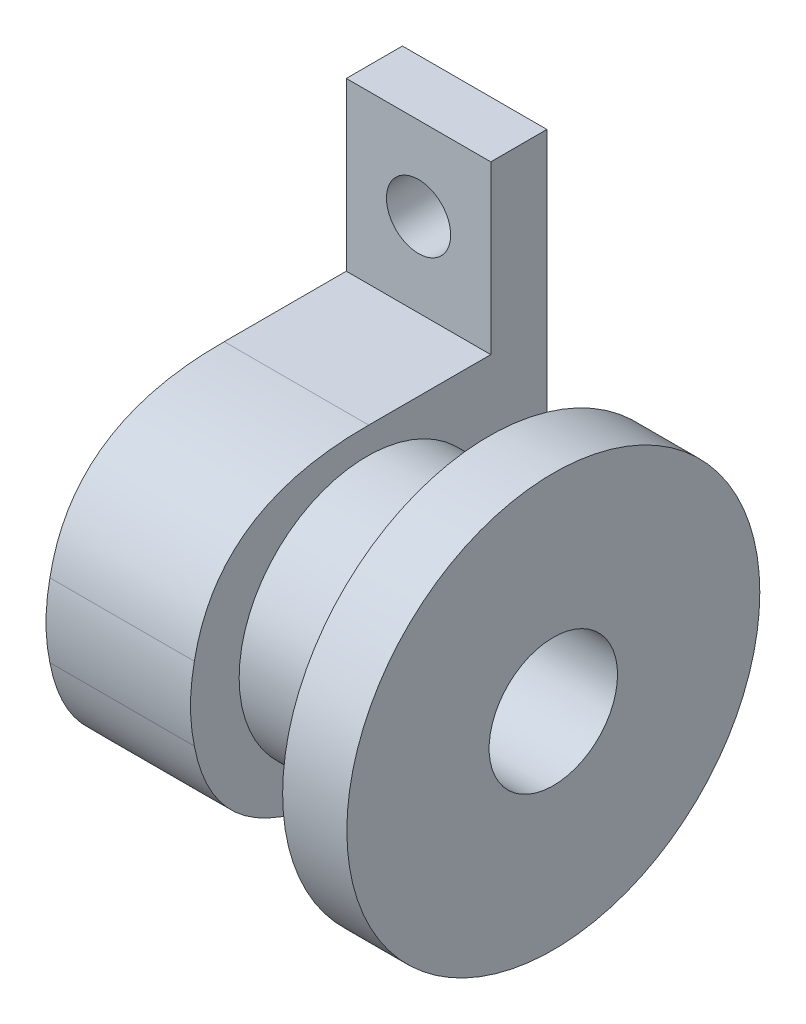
ISO-10303-21;
HEADER;
FILE_DESCRIPTION(('STEP AP214'),'2;1');
FILE_NAME('part.step','',(''),(''),'','','');
FILE_SCHEMA(('AUTOMOTIVE_DESIGN { 1 0 10303 214 1 1 1 1 }'));
ENDSEC;
DATA;
#1=APPLICATION_CONTEXT('core data for automotive mechanical design processes');
#2=APPLICATION_PROTOCOL_DEFINITION('international standard','automotive_design',2000,#1);
#3=PRODUCT_CONTEXT('',#1,'mechanical');
#4=PRODUCT('Part','Part','',(#3));
#5=PRODUCT_RELATED_PRODUCT_CATEGORY('part','',(#4));
#6=PRODUCT_DEFINITION_FORMATION('','',#4);
#7=PRODUCT_DEFINITION_CONTEXT('part definition',#1,'design');
#8=PRODUCT_DEFINITION('design','',#6,#7);
#9=PRODUCT_DEFINITION_SHAPE('','',#8);
#10=(LENGTH_UNIT() NAMED_UNIT(*) SI_UNIT(.MILLI.,.METRE.));
#11=(NAMED_UNIT(*) PLANE_ANGLE_UNIT() SI_UNIT($,.RADIAN.));
#12=(NAMED_UNIT(*) SI_UNIT($,.STERADIAN.) SOLID_ANGLE_UNIT());
#13=UNCERTAINTY_MEASURE_WITH_UNIT(LENGTH_MEASURE(1.E-05),#10,'distance_accuracy_value','');
#14=(GEOMETRIC_REPRESENTATION_CONTEXT(3) GLOBAL_UNCERTAINTY_ASSIGNED_CONTEXT((#13)) GLOBAL_UNIT_ASSIGNED_CONTEXT((#10,
#11,#12)) REPRESENTATION_CONTEXT('',''));
#15=CARTESIAN_POINT('',(0.,0.,0.));
#16=DIRECTION('',(0.,0.,1.));
#17=DIRECTION('',(1.,0.,0.));
#18=AXIS2_PLACEMENT_3D('',#15,#16,#17);
#19=CARTESIAN_POINT('',(22.5,-50.,8.7420219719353));
#20=DIRECTION('',(1.,0.,0.));
#21=DIRECTION('',(0.,0.,-1.));
#22=AXIS2_PLACEMENT_3D('',#19,#20,#21);
#23=PLANE('',#22);
#24=CARTESIAN_POINT('',(22.5,0.,28.));
#25=DIRECTION('',(1.,0.,0.));
#26=DIRECTION('',(0.,0.,-1.));
#27=AXIS2_PLACEMENT_3D('',#24,#25,#26);
#28=CIRCLE('',#27,10.);
#29=CARTESIAN_POINT('',(22.5,0.,18.));
#30=VERTEX_POINT('',#29);
#31=EDGE_CURVE('E157',#30,#30,#28,.F.);
#32=ORIENTED_EDGE('',*,*,#31,.T.);
#33=EDGE_LOOP('',(#32));
#34=FACE_BOUND('',#33,.T.);
#35=DIRECTION('',(0.,-1.,0.));
#36=VECTOR('',#35,1.);
#37=CARTESIAN_POINT('',(22.5,0.,8.7420219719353));
#38=LINE('',#37,#36);
#39=CARTESIAN_POINT('',(22.5,-24.,8.7420219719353));
#40=VERTEX_POINT('',#39);
#41=CARTESIAN_POINT('',(22.5,-50.,8.7420219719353));
#42=VERTEX_POINT('',#41);
#43=EDGE_CURVE('E329',#40,#42,#38,.T.);
#44=ORIENTED_EDGE('',*,*,#43,.T.);
#45=DIRECTION('',(0.,0.,-1.));
#46=VECTOR('',#45,1.);
#47=CARTESIAN_POINT('',(22.5,-50.,55.5));
#48=LINE('',#47,#46);
#49=CARTESIAN_POINT('',(22.5,-50.,0.));
#50=VERTEX_POINT('',#49);
#51=EDGE_CURVE('E252',#42,#50,#48,.T.);
#52=ORIENTED_EDGE('',*,*,#51,.T.);
#53=DIRECTION('',(0.,1.,0.));
#54=VECTOR('',#53,1.);
#55=CARTESIAN_POINT('',(22.5,-50.,0.));
#56=LINE('',#55,#54);
#57=CARTESIAN_POINT('',(22.5,50.,0.));
#58=VERTEX_POINT('',#57);
#59=EDGE_CURVE('E251',#50,#58,#56,.T.);
#60=ORIENTED_EDGE('',*,*,#59,.T.);
#61=DIRECTION('',(0.,0.,-1.));
#62=VECTOR('',#61,1.);
#63=CARTESIAN_POINT('',(22.5,50.,55.5));
#64=LINE('',#63,#62);
#65=CARTESIAN_POINT('',(22.5,50.,8.7420219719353));
#66=VERTEX_POINT('',#65);
#67=EDGE_CURVE('E241',#66,#58,#64,.T.);
#68=ORIENTED_EDGE('',*,*,#67,.F.);
#69=DIRECTION('',(0.,1.,0.));
#70=VECTOR('',#69,1.);
#71=CARTESIAN_POINT('',(22.5,0.,8.7420219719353));
#72=LINE('',#71,#70);
#73=CARTESIAN_POINT('',(22.5,24.,8.7420219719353));
#74=VERTEX_POINT('',#73);
#75=EDGE_CURVE('E280',#74,#66,#72,.T.);
#76=ORIENTED_EDGE('',*,*,#75,.F.);
#77=DIRECTION('',(0.,0.,1.));
#78=VECTOR('',#77,1.);
#79=CARTESIAN_POINT('',(22.5,24.,0.));
#80=LINE('',#79,#78);
#81=CARTESIAN_POINT('',(22.5,24.,27.75));
#82=VERTEX_POINT('',#81);
#83=EDGE_CURVE('E400',#74,#82,#80,.T.);
#84=ORIENTED_EDGE('',*,*,#83,.T.);
#85=CARTESIAN_POINT('',(22.5,0.,55.5));
#86=CARTESIAN_POINT('',(22.5,24.2004229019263,54.7772443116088));
#87=CARTESIAN_POINT('',(22.5,24.,27.75));
#88=B_SPLINE_CURVE_WITH_KNOTS('',2,(#85,#86,#87),.UNSPECIFIED.,.F.,.F.,(3,3),(0.,1.),.UNSPECIFIED.);
#89=CARTESIAN_POINT('',(22.5,5.71932993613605,54.8986851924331));
#90=VERTEX_POINT('',#89);
#91=EDGE_CURVE('E272',#90,#82,#88,.T.);
#92=ORIENTED_EDGE('',*,*,#91,.F.);
#93=CARTESIAN_POINT('',(22.5,0.,28.));
#94=DIRECTION('',(1.,0.,0.));
#95=DIRECTION('',(0.,0.,-1.));
#96=AXIS2_PLACEMENT_3D('',#93,#94,#95);
#97=CIRCLE('',#96,27.5);
#98=CARTESIAN_POINT('',(22.5,-5.7193299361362,54.898685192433));
#99=VERTEX_POINT('',#98);
#100=EDGE_CURVE('E268',#90,#99,#97,.T.);
#101=ORIENTED_EDGE('',*,*,#100,.T.);
#102=CARTESIAN_POINT('',(22.5,0.,55.5));
#103=CARTESIAN_POINT('',(22.5,-24.2004229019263,54.7772443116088));
#104=CARTESIAN_POINT('',(22.5,-24.,27.75));
#105=B_SPLINE_CURVE_WITH_KNOTS('',2,(#102,#103,#104),.UNSPECIFIED.,.F.,.F.,(3,3),(0.,1.),.UNSPECIFIED.);
#106=CARTESIAN_POINT('',(22.5,-24.,27.75));
#107=VERTEX_POINT('',#106);
#108=EDGE_CURVE('E427',#99,#107,#105,.T.);
#109=ORIENTED_EDGE('',*,*,#108,.T.);
#110=DIRECTION('',(0.,0.,1.));
#111=VECTOR('',#110,1.);
#112=CARTESIAN_POINT('',(22.5,-24.,0.));
#113=LINE('',#112,#111);
#114=EDGE_CURVE('E339',#40,#107,#113,.T.);
#115=ORIENTED_EDGE('',*,*,#114,.F.);
#116=EDGE_LOOP('',(#44,#52,#60,#68,#76,#84,#92,#101,#109,#115));
#117=FACE_BOUND('',#116,.T.);
#118=ADVANCED_FACE('F153',(#34,#117),#23,.T.);
#119=CARTESIAN_POINT('',(0.,0.,28.));
#120=DIRECTION('',(1.,0.,0.));
#121=DIRECTION('',(0.,0.,-1.));
#122=AXIS2_PLACEMENT_3D('',#119,#120,#121);
#123=CYLINDRICAL_SURFACE('',#122,10.);
#124=CARTESIAN_POINT('',(-5.,0.,28.));
#125=DIRECTION('',(-1.,0.,0.));
#126=DIRECTION('',(0.,0.,1.));
#127=AXIS2_PLACEMENT_3D('',#124,#125,#126);
#128=CIRCLE('',#127,10.);
#129=CARTESIAN_POINT('',(-5.,0.,18.));
#130=VERTEX_POINT('',#129);
#131=EDGE_CURVE('E13',#130,#130,#128,.F.);
#132=CARTESIAN_POINT('',(-5.,0.,18.));
#133=CARTESIAN_POINT('',(-4.71354166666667,0.,18.));
#134=CARTESIAN_POINT('',(-4.42708333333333,0.,18.));
#135=CARTESIAN_POINT('',(-3.85416666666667,0.,18.));
#136=CARTESIAN_POINT('',(-3.56770833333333,0.,18.));
#137=CARTESIAN_POINT('',(-2.99479166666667,0.,18.));
#138=CARTESIAN_POINT('',(-2.70833333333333,0.,18.));
#139=CARTESIAN_POINT('',(-2.13541666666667,0.,18.));
#140=CARTESIAN_POINT('',(-1.84895833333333,0.,18.));
#141=CARTESIAN_POINT('',(-1.27604166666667,0.,18.));
#142=CARTESIAN_POINT('',(-0.989583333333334,0.,18.));
#143=CARTESIAN_POINT('',(-0.416666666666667,0.,18.));
#144=CARTESIAN_POINT('',(-0.130208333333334,0.,18.));
#145=CARTESIAN_POINT('',(0.442708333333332,0.,18.));
#146=CARTESIAN_POINT('',(0.729166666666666,0.,18.));
#147=CARTESIAN_POINT('',(1.30208333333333,0.,18.));
#148=CARTESIAN_POINT('',(1.58854166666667,0.,18.));
#149=CARTESIAN_POINT('',(2.16145833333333,0.,18.));
#150=CARTESIAN_POINT('',(2.44791666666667,0.,18.));
#151=CARTESIAN_POINT('',(3.02083333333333,0.,18.));
#152=CARTESIAN_POINT('',(3.30729166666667,0.,18.));
#153=CARTESIAN_POINT('',(3.88020833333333,0.,18.));
#154=CARTESIAN_POINT('',(4.16666666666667,0.,18.));
#155=CARTESIAN_POINT('',(4.73958333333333,0.,18.));
#156=CARTESIAN_POINT('',(5.02604166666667,0.,18.));
#157=CARTESIAN_POINT('',(5.59895833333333,0.,18.));
#158=CARTESIAN_POINT('',(5.88541666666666,0.,18.));
#159=CARTESIAN_POINT('',(6.45833333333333,0.,18.));
#160=CARTESIAN_POINT('',(6.74479166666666,0.,18.));
#161=CARTESIAN_POINT('',(7.31770833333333,0.,18.));
#162=CARTESIAN_POINT('',(7.60416666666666,0.,18.));
#163=CARTESIAN_POINT('',(8.17708333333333,0.,18.));
#164=CARTESIAN_POINT('',(8.46354166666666,0.,18.));
#165=CARTESIAN_POINT('',(9.03645833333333,0.,18.));
#166=CARTESIAN_POINT('',(9.32291666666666,0.,18.));
#167=CARTESIAN_POINT('',(9.89583333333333,0.,18.));
#168=CARTESIAN_POINT('',(10.1822916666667,0.,18.));
#169=CARTESIAN_POINT('',(10.7552083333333,0.,18.));
#170=CARTESIAN_POINT('',(11.0416666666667,0.,18.));
#171=CARTESIAN_POINT('',(11.6145833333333,0.,18.));
#172=CARTESIAN_POINT('',(11.9010416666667,0.,18.));
#173=CARTESIAN_POINT('',(12.4739583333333,0.,18.));
#174=CARTESIAN_POINT('',(12.7604166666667,0.,18.));
#175=CARTESIAN_POINT('',(13.3333333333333,0.,18.));
#176=CARTESIAN_POINT('',(13.6197916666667,0.,18.));
#177=CARTESIAN_POINT('',(14.1927083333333,0.,18.));
#178=CARTESIAN_POINT('',(14.4791666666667,0.,18.));
#179=CARTESIAN_POINT('',(15.0520833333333,0.,18.));
#180=CARTESIAN_POINT('',(15.3385416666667,0.,18.));
#181=CARTESIAN_POINT('',(15.9114583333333,0.,18.));
#182=CARTESIAN_POINT('',(16.1979166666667,0.,18.));
#183=CARTESIAN_POINT('',(16.7708333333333,0.,18.));
#184=CARTESIAN_POINT('',(17.0572916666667,0.,18.));
#185=CARTESIAN_POINT('',(17.6302083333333,0.,18.));
#186=CARTESIAN_POINT('',(17.9166666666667,0.,18.));
#187=CARTESIAN_POINT('',(18.4895833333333,0.,18.));
#188=CARTESIAN_POINT('',(18.7760416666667,0.,18.));
#189=CARTESIAN_POINT('',(19.3489583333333,0.,18.));
#190=CARTESIAN_POINT('',(19.6354166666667,0.,18.));
#191=CARTESIAN_POINT('',(20.2083333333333,0.,18.));
#192=CARTESIAN_POINT('',(20.4947916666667,0.,18.));
#193=CARTESIAN_POINT('',(21.0677083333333,0.,18.));
#194=CARTESIAN_POINT('',(21.3541666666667,0.,18.));
#195=CARTESIAN_POINT('',(21.9270833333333,0.,18.));
#196=CARTESIAN_POINT('',(22.2135416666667,0.,18.));
#197=CARTESIAN_POINT('',(22.5,0.,18.));
#198=B_SPLINE_CURVE_WITH_KNOTS('',3,(#132,#133,#134,#135,#136,#137,#138,#139,#140,#141,#142,
#143,#144,#145,#146,#147,#148,#149,#150,#151,#152,#153,#154,#155,#156,#157,#158,#159,#160,#161,
#162,#163,#164,#165,#166,#167,#168,#169,#170,#171,#172,#173,#174,#175,#176,#177,#178,#179,#180,
#181,#182,#183,#184,#185,#186,#187,#188,#189,#190,#191,#192,#193,#194,#195,#196,#197),
.UNSPECIFIED.,.F.,.F.,(4,2,2,2,2,2,2,2,2,2,2,2,2,2,2,2,2,2,2,2,2,2,2,2,2,2,2,2,2,2,2,2,4),(0.,
0.859375,1.71875,2.578125,3.4375,4.296875,5.15625,6.015625,6.875,7.734375,8.59375,9.453125,
10.3125,11.171875,12.03125,12.890625,13.75,14.609375,15.46875,16.328125,17.1875,18.046875,
18.90625,19.765625,20.625,21.484375,22.34375,23.203125,24.0625,24.921875,25.78125,26.640625,
27.5),.UNSPECIFIED.);
#199=EDGE_CURVE('BSEAM155',#130,#30,#198,.T.);
#200=ORIENTED_EDGE('',*,*,#131,.F.);
#201=ORIENTED_EDGE('',*,*,#31,.F.);
#202=ORIENTED_EDGE('',*,*,#199,.T.);
#203=ORIENTED_EDGE('',*,*,#199,.F.);
#204=EDGE_LOOP('',(#200,#202,#201,#203));
#205=FACE_BOUND('',#204,.T.);
#206=ADVANCED_FACE('F155',(#205),#123,.F.);
#207=CARTESIAN_POINT('',(0.,-50.,55.5));
#208=DIRECTION('',(1.,0.,0.));
#209=DIRECTION('',(0.,0.,-1.));
#210=AXIS2_PLACEMENT_3D('',#207,#208,#209);
#211=PLANE('',#210);
#212=CARTESIAN_POINT('',(0.,0.,28.));
#213=DIRECTION('',(1.,0.,0.));
#214=DIRECTION('',(0.,0.,-1.));
#215=AXIS2_PLACEMENT_3D('',#212,#213,#214);
#216=CIRCLE('',#215,12.);
#217=CARTESIAN_POINT('',(0.,0.,16.));
#218=VERTEX_POINT('',#217);
#219=EDGE_CURVE('E360',#218,#218,#216,.F.);
#220=ORIENTED_EDGE('',*,*,#219,.F.);
#221=EDGE_LOOP('',(#220));
#222=FACE_BOUND('',#221,.T.);
#223=DIRECTION('',(0.,-1.,0.));
#224=VECTOR('',#223,1.);
#225=CARTESIAN_POINT('',(0.,0.,8.7420219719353));
#226=LINE('',#225,#224);
#227=CARTESIAN_POINT('',(0.,-24.,8.7420219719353));
#228=VERTEX_POINT('',#227);
#229=CARTESIAN_POINT('',(0.,-50.,8.7420219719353));
#230=VERTEX_POINT('',#229);
#231=EDGE_CURVE('E321',#228,#230,#226,.T.);
#232=ORIENTED_EDGE('',*,*,#231,.F.);
#233=DIRECTION('',(0.,0.,1.));
#234=VECTOR('',#233,1.);
#235=CARTESIAN_POINT('',(0.,-24.,0.));
#236=LINE('',#235,#234);
#237=CARTESIAN_POINT('',(0.,-24.,27.75));
#238=VERTEX_POINT('',#237);
#239=EDGE_CURVE('E320',#228,#238,#236,.T.);
#240=ORIENTED_EDGE('',*,*,#239,.T.);
#241=CARTESIAN_POINT('',(0.,0.,55.5));
#242=CARTESIAN_POINT('',(0.,-24.2004229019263,54.7772443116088));
#243=CARTESIAN_POINT('',(0.,-24.,27.75));
#244=B_SPLINE_CURVE_WITH_KNOTS('',2,(#241,#242,#243),.UNSPECIFIED.,.F.,.F.,(3,3),(0.,1.),.UNSPECIFIED.);
#245=CARTESIAN_POINT('',(0.,-5.7193299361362,54.898685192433));
#246=VERTEX_POINT('',#245);
#247=EDGE_CURVE('E195',#246,#238,#244,.T.);
#248=ORIENTED_EDGE('',*,*,#247,.F.);
#249=CARTESIAN_POINT('',(0.,0.,28.));
#250=DIRECTION('',(1.,0.,0.));
#251=DIRECTION('',(0.,0.,-1.));
#252=AXIS2_PLACEMENT_3D('',#249,#250,#251);
#253=CIRCLE('',#252,27.5);
#254=CARTESIAN_POINT('',(0.,5.71932993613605,54.8986851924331));
#255=VERTEX_POINT('',#254);
#256=EDGE_CURVE('E191',#255,#246,#253,.T.);
#257=ORIENTED_EDGE('',*,*,#256,.F.);
#258=CARTESIAN_POINT('',(0.,0.,55.5));
#259=CARTESIAN_POINT('',(0.,24.2004229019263,54.7772443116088));
#260=CARTESIAN_POINT('',(0.,24.,27.75));
#261=B_SPLINE_CURVE_WITH_KNOTS('',2,(#258,#259,#260),.UNSPECIFIED.,.F.,.F.,(3,3),(0.,1.),.UNSPECIFIED.);
#262=CARTESIAN_POINT('',(0.,24.,27.75));
#263=VERTEX_POINT('',#262);
#264=EDGE_CURVE('E279',#255,#263,#261,.T.);
#265=ORIENTED_EDGE('',*,*,#264,.T.);
#266=DIRECTION('',(0.,0.,1.));
#267=VECTOR('',#266,1.);
#268=CARTESIAN_POINT('',(0.,24.,0.));
#269=LINE('',#268,#267);
#270=CARTESIAN_POINT('',(0.,24.,8.7420219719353));
#271=VERTEX_POINT('',#270);
#272=EDGE_CURVE('E287',#271,#263,#269,.T.);
#273=ORIENTED_EDGE('',*,*,#272,.F.);
#274=DIRECTION('',(0.,1.,0.));
#275=VECTOR('',#274,1.);
#276=CARTESIAN_POINT('',(0.,0.,8.7420219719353));
#277=LINE('',#276,#275);
#278=CARTESIAN_POINT('',(0.,50.,8.7420219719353));
#279=VERTEX_POINT('',#278);
#280=EDGE_CURVE('E386',#271,#279,#277,.T.);
#281=ORIENTED_EDGE('',*,*,#280,.T.);
#282=DIRECTION('',(0.,0.,-1.));
#283=VECTOR('',#282,1.);
#284=CARTESIAN_POINT('',(0.,50.,55.5));
#285=LINE('',#284,#283);
#286=CARTESIAN_POINT('',(0.,50.,0.));
#287=VERTEX_POINT('',#286);
#288=EDGE_CURVE('E363',#279,#287,#285,.T.);
#289=ORIENTED_EDGE('',*,*,#288,.T.);
#290=DIRECTION('',(0.,-1.,0.));
#291=VECTOR('',#290,1.);
#292=CARTESIAN_POINT('',(0.,-50.,0.));
#293=LINE('',#292,#291);
#294=CARTESIAN_POINT('',(0.,-50.,0.));
#295=VERTEX_POINT('',#294);
#296=EDGE_CURVE('E266',#287,#295,#293,.T.);
#297=ORIENTED_EDGE('',*,*,#296,.T.);
#298=DIRECTION('',(0.,0.,-1.));
#299=VECTOR('',#298,1.);
#300=CARTESIAN_POINT('',(0.,-50.,55.5));
#301=LINE('',#300,#299);
#302=EDGE_CURVE('E367',#230,#295,#301,.T.);
#303=ORIENTED_EDGE('',*,*,#302,.F.);
#304=EDGE_LOOP('',(#232,#240,#248,#257,#265,#273,#281,#289,#297,#303));
#305=FACE_BOUND('',#304,.T.);
#306=ADVANCED_FACE('F382',(#222,#305),#211,.F.);
#307=CARTESIAN_POINT('',(0.,-50.,55.5));
#308=DIRECTION('',(0.,1.,0.));
#309=DIRECTION('',(0.,0.,1.));
#310=AXIS2_PLACEMENT_3D('',#307,#308,#309);
#311=PLANE('',#310);
#312=DIRECTION('',(1.,0.,0.));
#313=VECTOR('',#312,1.);
#314=CARTESIAN_POINT('',(0.,-50.,8.7420219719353));
#315=LINE('',#314,#313);
#316=EDGE_CURVE('E379',#230,#42,#315,.T.);
#317=ORIENTED_EDGE('',*,*,#316,.F.);
#318=ORIENTED_EDGE('',*,*,#302,.T.);
#319=DIRECTION('',(1.,0.,0.));
#320=VECTOR('',#319,1.);
#321=CARTESIAN_POINT('',(0.,-50.,0.));
#322=LINE('',#321,#320);
#323=EDGE_CURVE('E261',#295,#50,#322,.T.);
#324=ORIENTED_EDGE('',*,*,#323,.T.);
#325=ORIENTED_EDGE('',*,*,#51,.F.);
#326=EDGE_LOOP('',(#317,#318,#324,#325));
#327=FACE_BOUND('',#326,.T.);
#328=ADVANCED_FACE('F377',(#327),#311,.F.);
#329=CARTESIAN_POINT('',(22.5,50.,55.5));
#330=DIRECTION('',(0.,-1.,0.));
#331=DIRECTION('',(0.,0.,-1.));
#332=AXIS2_PLACEMENT_3D('',#329,#330,#331);
#333=PLANE('',#332);
#334=ORIENTED_EDGE('',*,*,#288,.F.);
#335=DIRECTION('',(1.,0.,0.));
#336=VECTOR('',#335,1.);
#337=CARTESIAN_POINT('',(0.,50.,8.7420219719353));
#338=LINE('',#337,#336);
#339=EDGE_CURVE('E247',#279,#66,#338,.T.);
#340=ORIENTED_EDGE('',*,*,#339,.T.);
#341=ORIENTED_EDGE('',*,*,#67,.T.);
#342=DIRECTION('',(-1.,0.,0.));
#343=VECTOR('',#342,1.);
#344=CARTESIAN_POINT('',(22.5,50.,0.));
#345=LINE('',#344,#343);
#346=EDGE_CURVE('E246',#58,#287,#345,.T.);
#347=ORIENTED_EDGE('',*,*,#346,.T.);
#348=EDGE_LOOP('',(#334,#340,#341,#347));
#349=FACE_BOUND('',#348,.T.);
#350=ADVANCED_FACE('F244',(#349),#333,.F.);
#351=CARTESIAN_POINT('',(0.,0.,0.));
#352=DIRECTION('',(0.,0.,-1.));
#353=DIRECTION('',(-1.,0.,0.));
#354=AXIS2_PLACEMENT_3D('',#351,#352,#353);
#355=PLANE('',#354);
#356=CARTESIAN_POINT('',(11.25,-37.,0.));
#357=DIRECTION('',(0.,0.,1.));
#358=DIRECTION('',(1.,0.,0.));
#359=AXIS2_PLACEMENT_3D('',#356,#357,#358);
#360=CIRCLE('',#359,4.99843798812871);
#361=CARTESIAN_POINT('',(16.2484379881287,-37.,0.));
#362=VERTEX_POINT('',#361);
#363=EDGE_CURVE('E334',#362,#362,#360,.T.);
#364=ORIENTED_EDGE('',*,*,#363,.T.);
#365=EDGE_LOOP('',(#364));
#366=FACE_BOUND('',#365,.T.);
#367=CARTESIAN_POINT('',(11.25,37.,0.));
#368=DIRECTION('',(0.,0.,1.));
#369=DIRECTION('',(1.,0.,0.));
#370=AXIS2_PLACEMENT_3D('',#367,#368,#369);
#371=CIRCLE('',#370,5.);
#372=CARTESIAN_POINT('',(16.25,37.,0.));
#373=VERTEX_POINT('',#372);
#374=EDGE_CURVE('E335',#373,#373,#371,.T.);
#375=ORIENTED_EDGE('',*,*,#374,.T.);
#376=EDGE_LOOP('',(#375));
#377=FACE_BOUND('',#376,.T.);
#378=ORIENTED_EDGE('',*,*,#346,.F.);
#379=ORIENTED_EDGE('',*,*,#59,.F.);
#380=ORIENTED_EDGE('',*,*,#323,.F.);
#381=ORIENTED_EDGE('',*,*,#296,.F.);
#382=EDGE_LOOP('',(#378,#379,#380,#381));
#383=FACE_BOUND('',#382,.T.);
#384=ADVANCED_FACE('F264',(#366,#377,#383),#355,.T.);
#385=CARTESIAN_POINT('',(0.,0.,28.));
#386=DIRECTION('',(1.,0.,0.));
#387=DIRECTION('',(0.,0.,-1.));
#388=AXIS2_PLACEMENT_3D('',#385,#386,#387);
#389=CYLINDRICAL_SURFACE('',#388,27.5);
#390=ORIENTED_EDGE('',*,*,#100,.F.);
#391=DIRECTION('',(1.,0.,0.));
#392=VECTOR('',#391,1.);
#393=CARTESIAN_POINT('',(0.,5.71932993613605,54.8986851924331));
#394=LINE('',#393,#392);
#395=EDGE_CURVE('E389',#255,#90,#394,.T.);
#396=ORIENTED_EDGE('',*,*,#395,.F.);
#397=ORIENTED_EDGE('',*,*,#256,.T.);
#398=DIRECTION('',(1.,0.,0.));
#399=VECTOR('',#398,1.);
#400=CARTESIAN_POINT('',(0.,-5.7193299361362,54.898685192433));
#401=LINE('',#400,#399);
#402=EDGE_CURVE('E418',#246,#99,#401,.T.);
#403=ORIENTED_EDGE('',*,*,#402,.T.);
#404=EDGE_LOOP('',(#390,#396,#397,#403));
#405=FACE_BOUND('',#404,.T.);
#406=ADVANCED_FACE('F301',(#405),#389,.T.);
#407=CARTESIAN_POINT('',(0.,0.,8.7420219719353));
#408=DIRECTION('',(0.,0.,-1.));
#409=DIRECTION('',(0.,1.,0.));
#410=AXIS2_PLACEMENT_3D('',#407,#408,#409);
#411=PLANE('',#410);
#412=CARTESIAN_POINT('',(11.25,37.,8.7420219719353));
#413=DIRECTION('',(0.,0.,1.));
#414=DIRECTION('',(1.,0.,0.));
#415=AXIS2_PLACEMENT_3D('',#412,#413,#414);
#416=CIRCLE('',#415,5.);
#417=CARTESIAN_POINT('',(16.25,37.,8.7420219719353));
#418=VERTEX_POINT('',#417);
#419=EDGE_CURVE('E330',#418,#418,#416,.T.);
#420=ORIENTED_EDGE('',*,*,#419,.F.);
#421=EDGE_LOOP('',(#420));
#422=FACE_BOUND('',#421,.T.);
#423=ORIENTED_EDGE('',*,*,#75,.T.);
#424=ORIENTED_EDGE('',*,*,#339,.F.);
#425=ORIENTED_EDGE('',*,*,#280,.F.);
#426=DIRECTION('',(1.,0.,0.));
#427=VECTOR('',#426,1.);
#428=CARTESIAN_POINT('',(0.,24.,8.7420219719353));
#429=LINE('',#428,#427);
#430=EDGE_CURVE('E411',#271,#74,#429,.T.);
#431=ORIENTED_EDGE('',*,*,#430,.T.);
#432=EDGE_LOOP('',(#423,#424,#425,#431));
#433=FACE_BOUND('',#432,.T.);
#434=ADVANCED_FACE('F304',(#422,#433),#411,.F.);
#435=CARTESIAN_POINT('',(0.,24.,0.));
#436=DIRECTION('',(0.,1.,0.));
#437=DIRECTION('',(0.,0.,1.));
#438=AXIS2_PLACEMENT_3D('',#435,#436,#437);
#439=PLANE('',#438);
#440=ORIENTED_EDGE('',*,*,#83,.F.);
#441=ORIENTED_EDGE('',*,*,#430,.F.);
#442=ORIENTED_EDGE('',*,*,#272,.T.);
#443=DIRECTION('',(1.,0.,0.));
#444=VECTOR('',#443,1.);
#445=CARTESIAN_POINT('',(0.,24.,27.75));
#446=LINE('',#445,#444);
#447=EDGE_CURVE('E392',#263,#82,#446,.T.);
#448=ORIENTED_EDGE('',*,*,#447,.T.);
#449=EDGE_LOOP('',(#440,#441,#442,#448));
#450=FACE_BOUND('',#449,.T.);
#451=ADVANCED_FACE('F298',(#450),#439,.T.);
#452=DIRECTION('',(1.,0.,0.));
#453=VECTOR('',#452,1.);
#454=SURFACE_OF_LINEAR_EXTRUSION('',#261,#453);
#455=ORIENTED_EDGE('',*,*,#91,.T.);
#456=ORIENTED_EDGE('',*,*,#447,.F.);
#457=ORIENTED_EDGE('',*,*,#264,.F.);
#458=ORIENTED_EDGE('',*,*,#395,.T.);
#459=EDGE_LOOP('',(#455,#456,#457,#458));
#460=FACE_BOUND('',#459,.T.);
#461=ADVANCED_FACE('F293',(#460),#454,.F.);
#462=CARTESIAN_POINT('',(0.,-24.,0.));
#463=DIRECTION('',(0.,1.,0.));
#464=DIRECTION('',(0.,0.,1.));
#465=AXIS2_PLACEMENT_3D('',#462,#463,#464);
#466=PLANE('',#465);
#467=ORIENTED_EDGE('',*,*,#114,.T.);
#468=DIRECTION('',(1.,0.,0.));
#469=VECTOR('',#468,1.);
#470=CARTESIAN_POINT('',(0.,-24.,27.75));
#471=LINE('',#470,#469);
#472=EDGE_CURVE('E172',#238,#107,#471,.T.);
#473=ORIENTED_EDGE('',*,*,#472,.F.);
#474=ORIENTED_EDGE('',*,*,#239,.F.);
#475=DIRECTION('',(1.,0.,0.));
#476=VECTOR('',#475,1.);
#477=CARTESIAN_POINT('',(0.,-24.,8.7420219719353));
#478=LINE('',#477,#476);
#479=EDGE_CURVE('E200',#228,#40,#478,.T.);
#480=ORIENTED_EDGE('',*,*,#479,.T.);
#481=EDGE_LOOP('',(#467,#473,#474,#480));
#482=FACE_BOUND('',#481,.T.);
#483=ADVANCED_FACE('F297',(#482),#466,.F.);
#484=CARTESIAN_POINT('',(0.,0.,8.7420219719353));
#485=DIRECTION('',(0.,0.,1.));
#486=DIRECTION('',(0.,-1.,0.));
#487=AXIS2_PLACEMENT_3D('',#484,#485,#486);
#488=PLANE('',#487);
#489=CARTESIAN_POINT('',(11.25,-37.,8.7420219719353));
#490=DIRECTION('',(0.,0.,1.));
#491=DIRECTION('',(1.,0.,0.));
#492=AXIS2_PLACEMENT_3D('',#489,#490,#491);
#493=CIRCLE('',#492,4.99843798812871);
#494=CARTESIAN_POINT('',(16.2484379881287,-37.,8.7420219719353));
#495=VERTEX_POINT('',#494);
#496=EDGE_CURVE('E340',#495,#495,#493,.T.);
#497=ORIENTED_EDGE('',*,*,#496,.F.);
#498=EDGE_LOOP('',(#497));
#499=FACE_BOUND('',#498,.T.);
#500=ORIENTED_EDGE('',*,*,#43,.F.);
#501=ORIENTED_EDGE('',*,*,#479,.F.);
#502=ORIENTED_EDGE('',*,*,#231,.T.);
#503=ORIENTED_EDGE('',*,*,#316,.T.);
#504=EDGE_LOOP('',(#500,#501,#502,#503));
#505=FACE_BOUND('',#504,.T.);
#506=ADVANCED_FACE('F307',(#499,#505),#488,.T.);
#507=DIRECTION('',(1.,0.,0.));
#508=VECTOR('',#507,1.);
#509=SURFACE_OF_LINEAR_EXTRUSION('',#244,#508);
#510=ORIENTED_EDGE('',*,*,#108,.F.);
#511=ORIENTED_EDGE('',*,*,#402,.F.);
#512=ORIENTED_EDGE('',*,*,#247,.T.);
#513=ORIENTED_EDGE('',*,*,#472,.T.);
#514=EDGE_LOOP('',(#510,#511,#512,#513));
#515=FACE_BOUND('',#514,.T.);
#516=ADVANCED_FACE('F308',(#515),#509,.T.);
#517=CARTESIAN_POINT('',(11.25,37.,0.));
#518=DIRECTION('',(0.,0.,1.));
#519=DIRECTION('',(1.,0.,0.));
#520=AXIS2_PLACEMENT_3D('',#517,#518,#519);
#521=CYLINDRICAL_SURFACE('',#520,5.);
#522=ORIENTED_EDGE('',*,*,#374,.F.);
#523=EDGE_LOOP('',(#522));
#524=FACE_BOUND('',#523,.T.);
#525=ORIENTED_EDGE('',*,*,#419,.T.);
#526=EDGE_LOOP('',(#525));
#527=FACE_BOUND('',#526,.T.);
#528=ADVANCED_FACE('F312',(#524,#527),#521,.F.);
#529=CARTESIAN_POINT('',(11.25,-37.,0.));
#530=DIRECTION('',(0.,0.,1.));
#531=DIRECTION('',(1.,0.,0.));
#532=AXIS2_PLACEMENT_3D('',#529,#530,#531);
#533=CYLINDRICAL_SURFACE('',#532,4.99843798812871);
#534=ORIENTED_EDGE('',*,*,#363,.F.);
#535=EDGE_LOOP('',(#534));
#536=FACE_BOUND('',#535,.T.);
#537=ORIENTED_EDGE('',*,*,#496,.T.);
#538=EDGE_LOOP('',(#537));
#539=FACE_BOUND('',#538,.T.);
#540=ADVANCED_FACE('F356',(#536,#539),#533,.F.);
#541=CARTESIAN_POINT('',(-5.,0.,28.));
#542=DIRECTION('',(1.,0.,0.));
#543=DIRECTION('',(0.,0.,-1.));
#544=AXIS2_PLACEMENT_3D('',#541,#542,#543);
#545=CYLINDRICAL_SURFACE('',#544,12.);
#546=CARTESIAN_POINT('',(-5.,0.,28.));
#547=DIRECTION('',(-1.,0.,0.));
#548=DIRECTION('',(0.,0.,1.));
#549=AXIS2_PLACEMENT_3D('',#546,#547,#548);
#550=CIRCLE('',#549,12.);
#551=CARTESIAN_POINT('',(-5.,0.,40.));
#552=VERTEX_POINT('',#551);
#553=EDGE_CURVE('E164',#552,#552,#550,.T.);
#554=ORIENTED_EDGE('',*,*,#553,.F.);
#555=EDGE_LOOP('',(#554));
#556=FACE_BOUND('',#555,.T.);
#557=ORIENTED_EDGE('',*,*,#219,.T.);
#558=EDGE_LOOP('',(#557));
#559=FACE_BOUND('',#558,.T.);
#560=ADVANCED_FACE('F353',(#556,#559),#545,.T.);
#561=CARTESIAN_POINT('',(-5.,0.,0.));
#562=DIRECTION('',(-1.,0.,0.));
#563=DIRECTION('',(0.,0.,1.));
#564=AXIS2_PLACEMENT_3D('',#561,#562,#563);
#565=PLANE('',#564);
#566=ORIENTED_EDGE('',*,*,#131,.T.);
#567=EDGE_LOOP('',(#566));
#568=FACE_BOUND('',#567,.T.);
#569=ORIENTED_EDGE('',*,*,#553,.T.);
#570=EDGE_LOOP('',(#569));
#571=FACE_BOUND('',#570,.T.);
#572=ADVANCED_FACE('F351',(#568,#571),#565,.T.);
#573=CLOSED_SHELL('',(#118,#206,#306,#328,#350,#384,#406,#434,#451,#461,#483,#506,#516,#528,
#540,#560,#572));
#574=MANIFOLD_SOLID_BREP('B2',#573);
#575=CARTESIAN_POINT('',(22.5,-50.,8.7420219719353));
#576=DIRECTION('',(1.,0.,0.));
#577=DIRECTION('',(0.,0.,-1.));
#578=AXIS2_PLACEMENT_3D('',#575,#576,#577);
#579=PLANE('',#578);
#580=CARTESIAN_POINT('',(22.5,0.,28.));
#581=DIRECTION('',(1.,0.,0.));
#582=DIRECTION('',(0.,0.,-1.));
#583=AXIS2_PLACEMENT_3D('',#580,#581,#582);
#584=CIRCLE('',#583,19.9273838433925);
#585=CARTESIAN_POINT('',(22.5,0.,8.0726161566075));
#586=VERTEX_POINT('',#585);
#587=EDGE_CURVE('E607',#586,#586,#584,.T.);
#588=ORIENTED_EDGE('',*,*,#587,.F.);
#589=EDGE_LOOP('',(#588));
#590=FACE_BOUND('',#589,.T.);
#591=CARTESIAN_POINT('',(22.5,0.,28.));
#592=DIRECTION('',(1.,0.,0.));
#593=DIRECTION('',(0.,0.,-1.));
#594=AXIS2_PLACEMENT_3D('',#591,#592,#593);
#595=CIRCLE('',#594,10.);
#596=CARTESIAN_POINT('',(22.5,0.,18.));
#597=VERTEX_POINT('',#596);
#598=EDGE_CURVE('E152',#597,#597,#595,.F.);
#599=ORIENTED_EDGE('',*,*,#598,.F.);
#600=EDGE_LOOP('',(#599));
#601=FACE_BOUND('',#600,.T.);
#602=ADVANCED_FACE('F601',(#590,#601),#579,.F.);
#603=CARTESIAN_POINT('',(51.5,0.,28.));
#604=DIRECTION('',(-1.,0.,0.));
#605=DIRECTION('',(0.,0.,1.));
#606=AXIS2_PLACEMENT_3D('',#603,#604,#605);
#607=CYLINDRICAL_SURFACE('',#606,32.1556925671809);
#608=CARTESIAN_POINT('',(51.5,0.,28.));
#609=DIRECTION('',(1.,0.,0.));
#610=DIRECTION('',(0.,0.,-1.));
#611=AXIS2_PLACEMENT_3D('',#608,#609,#610);
#612=CIRCLE('',#611,32.1556925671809);
#613=CARTESIAN_POINT('',(51.5,0.,-4.15569256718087));
#614=VERTEX_POINT('',#613);
#615=EDGE_CURVE('E615',#614,#614,#612,.T.);
#616=ORIENTED_EDGE('',*,*,#615,.F.);
#617=EDGE_LOOP('',(#616));
#618=FACE_BOUND('',#617,.T.);
#619=CARTESIAN_POINT('',(41.5,0.,28.));
#620=DIRECTION('',(1.,0.,0.));
#621=DIRECTION('',(0.,0.,-1.));
#622=AXIS2_PLACEMENT_3D('',#619,#620,#621);
#623=CIRCLE('',#622,32.1556925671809);
#624=CARTESIAN_POINT('',(41.5,0.,-4.15569256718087));
#625=VERTEX_POINT('',#624);
#626=EDGE_CURVE('E618',#625,#625,#623,.T.);
#627=ORIENTED_EDGE('',*,*,#626,.T.);
#628=EDGE_LOOP('',(#627));
#629=FACE_BOUND('',#628,.T.);
#630=ADVANCED_FACE('F645',(#618,#629),#607,.T.);
#631=CARTESIAN_POINT('',(41.5,0.,28.));
#632=DIRECTION('',(1.,0.,0.));
#633=DIRECTION('',(0.,0.,-1.));
#634=AXIS2_PLACEMENT_3D('',#631,#632,#633);
#635=PLANE('',#634);
#636=CARTESIAN_POINT('',(41.5,0.,28.));
#637=DIRECTION('',(1.,0.,0.));
#638=DIRECTION('',(0.,0.,-1.));
#639=AXIS2_PLACEMENT_3D('',#636,#637,#638);
#640=CIRCLE('',#639,19.9273838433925);
#641=CARTESIAN_POINT('',(41.5,0.,8.0726161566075));
#642=VERTEX_POINT('',#641);
#643=EDGE_CURVE('E611',#642,#642,#640,.T.);
#644=ORIENTED_EDGE('',*,*,#643,.T.);
#645=EDGE_LOOP('',(#644));
#646=FACE_BOUND('',#645,.T.);
#647=ORIENTED_EDGE('',*,*,#626,.F.);
#648=EDGE_LOOP('',(#647));
#649=FACE_BOUND('',#648,.T.);
#650=ADVANCED_FACE('F640',(#646,#649),#635,.F.);
#651=CARTESIAN_POINT('',(41.5,0.,28.));
#652=DIRECTION('',(-1.,0.,0.));
#653=DIRECTION('',(0.,0.,1.));
#654=AXIS2_PLACEMENT_3D('',#651,#652,#653);
#655=CYLINDRICAL_SURFACE('',#654,19.9273838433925);
#656=ORIENTED_EDGE('',*,*,#643,.F.);
#657=EDGE_LOOP('',(#656));
#658=FACE_BOUND('',#657,.T.);
#659=ORIENTED_EDGE('',*,*,#587,.T.);
#660=EDGE_LOOP('',(#659));
#661=FACE_BOUND('',#660,.T.);
#662=ADVANCED_FACE('F631',(#658,#661),#655,.T.);
#663=CARTESIAN_POINT('',(51.5,0.,28.));
#664=DIRECTION('',(1.,0.,0.));
#665=DIRECTION('',(0.,0.,-1.));
#666=AXIS2_PLACEMENT_3D('',#663,#664,#665);
#667=PLANE('',#666);
#668=ORIENTED_EDGE('',*,*,#615,.T.);
#669=EDGE_LOOP('',(#668));
#670=FACE_BOUND('',#669,.T.);
#671=CARTESIAN_POINT('',(51.5,0.,28.));
#672=DIRECTION('',(1.,0.,0.));
#673=DIRECTION('',(0.,0.,-1.));
#674=AXIS2_PLACEMENT_3D('',#671,#672,#673);
#675=CIRCLE('',#674,10.);
#676=CARTESIAN_POINT('',(51.5,0.,18.));
#677=VERTEX_POINT('',#676);
#678=EDGE_CURVE('E621',#677,#677,#675,.T.);
#679=ORIENTED_EDGE('',*,*,#678,.F.);
#680=EDGE_LOOP('',(#679));
#681=FACE_BOUND('',#680,.T.);
#682=ADVANCED_FACE('F629',(#670,#681),#667,.T.);
#683=CARTESIAN_POINT('',(0.,0.,28.));
#684=DIRECTION('',(1.,0.,0.));
#685=DIRECTION('',(0.,0.,-1.));
#686=AXIS2_PLACEMENT_3D('',#683,#684,#685);
#687=CYLINDRICAL_SURFACE('',#686,10.);
#688=CARTESIAN_POINT('',(22.5,0.,18.));
#689=CARTESIAN_POINT('',(22.8020833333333,0.,18.));
#690=CARTESIAN_POINT('',(23.1041666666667,0.,18.));
#691=CARTESIAN_POINT('',(23.7083333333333,0.,18.));
#692=CARTESIAN_POINT('',(24.0104166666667,0.,18.));
#693=CARTESIAN_POINT('',(24.6145833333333,0.,18.));
#694=CARTESIAN_POINT('',(24.9166666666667,0.,18.));
#695=CARTESIAN_POINT('',(25.5208333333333,0.,18.));
#696=CARTESIAN_POINT('',(25.8229166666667,0.,18.));
#697=CARTESIAN_POINT('',(26.4270833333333,0.,18.));
#698=CARTESIAN_POINT('',(26.7291666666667,0.,18.));
#699=CARTESIAN_POINT('',(27.3333333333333,0.,18.));
#700=CARTESIAN_POINT('',(27.6354166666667,0.,18.));
#701=CARTESIAN_POINT('',(28.2395833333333,0.,18.));
#702=CARTESIAN_POINT('',(28.5416666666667,0.,18.));
#703=CARTESIAN_POINT('',(29.1458333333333,0.,18.));
#704=CARTESIAN_POINT('',(29.4479166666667,0.,18.));
#705=CARTESIAN_POINT('',(30.0520833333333,0.,18.));
#706=CARTESIAN_POINT('',(30.3541666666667,0.,18.));
#707=CARTESIAN_POINT('',(30.9583333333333,0.,18.));
#708=CARTESIAN_POINT('',(31.2604166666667,0.,18.));
#709=CARTESIAN_POINT('',(31.8645833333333,0.,18.));
#710=CARTESIAN_POINT('',(32.1666666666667,0.,18.));
#711=CARTESIAN_POINT('',(32.7708333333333,0.,18.));
#712=CARTESIAN_POINT('',(33.0729166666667,0.,18.));
#713=CARTESIAN_POINT('',(33.6770833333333,0.,18.));
#714=CARTESIAN_POINT('',(33.9791666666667,0.,18.));
#715=CARTESIAN_POINT('',(34.5833333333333,0.,18.));
#716=CARTESIAN_POINT('',(34.8854166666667,0.,18.));
#717=CARTESIAN_POINT('',(35.4895833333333,0.,18.));
#718=CARTESIAN_POINT('',(35.7916666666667,0.,18.));
#719=CARTESIAN_POINT('',(36.3958333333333,0.,18.));
#720=CARTESIAN_POINT('',(36.6979166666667,0.,18.));
#721=CARTESIAN_POINT('',(37.3020833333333,0.,18.));
#722=CARTESIAN_POINT('',(37.6041666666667,0.,18.));
#723=CARTESIAN_POINT('',(38.2083333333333,0.,18.));
#724=CARTESIAN_POINT('',(38.5104166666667,0.,18.));
#725=CARTESIAN_POINT('',(39.1145833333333,0.,18.));
#726=CARTESIAN_POINT('',(39.4166666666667,0.,18.));
#727=CARTESIAN_POINT('',(40.0208333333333,0.,18.));
#728=CARTESIAN_POINT('',(40.3229166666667,0.,18.));
#729=CARTESIAN_POINT('',(40.9270833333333,0.,18.));
#730=CARTESIAN_POINT('',(41.2291666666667,0.,18.));
#731=CARTESIAN_POINT('',(41.8333333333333,0.,18.));
#732=CARTESIAN_POINT('',(42.1354166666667,0.,18.));
#733=CARTESIAN_POINT('',(42.7395833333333,0.,18.));
#734=CARTESIAN_POINT('',(43.0416666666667,0.,18.));
#735=CARTESIAN_POINT('',(43.6458333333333,0.,18.));
#736=CARTESIAN_POINT('',(43.9479166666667,0.,18.));
#737=CARTESIAN_POINT('',(44.5520833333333,0.,18.));
#738=CARTESIAN_POINT('',(44.8541666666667,0.,18.));
#739=CARTESIAN_POINT('',(45.4583333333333,0.,18.));
#740=CARTESIAN_POINT('',(45.7604166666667,0.,18.));
#741=CARTESIAN_POINT('',(46.3645833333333,0.,18.));
#742=CARTESIAN_POINT('',(46.6666666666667,0.,18.));
#743=CARTESIAN_POINT('',(47.2708333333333,0.,18.));
#744=CARTESIAN_POINT('',(47.5729166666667,0.,18.));
#745=CARTESIAN_POINT('',(48.1770833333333,0.,18.));
#746=CARTESIAN_POINT('',(48.4791666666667,0.,18.));
#747=CARTESIAN_POINT('',(49.0833333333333,0.,18.));
#748=CARTESIAN_POINT('',(49.3854166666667,0.,18.));
#749=CARTESIAN_POINT('',(49.9895833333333,0.,18.));
#750=CARTESIAN_POINT('',(50.2916666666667,0.,18.));
#751=CARTESIAN_POINT('',(50.8958333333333,0.,18.));
#752=CARTESIAN_POINT('',(51.1979166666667,0.,18.));
#753=CARTESIAN_POINT('',(51.5,0.,18.));
#754=B_SPLINE_CURVE_WITH_KNOTS('',3,(#688,#689,#690,#691,#692,#693,#694,#695,#696,#697,#698,
#699,#700,#701,#702,#703,#704,#705,#706,#707,#708,#709,#710,#711,#712,#713,#714,#715,#716,#717,
#718,#719,#720,#721,#722,#723,#724,#725,#726,#727,#728,#729,#730,#731,#732,#733,#734,#735,#736,
#737,#738,#739,#740,#741,#742,#743,#744,#745,#746,#747,#748,#749,#750,#751,#752,#753),
.UNSPECIFIED.,.F.,.F.,(4,2,2,2,2,2,2,2,2,2,2,2,2,2,2,2,2,2,2,2,2,2,2,2,2,2,2,2,2,2,2,2,4),(0.,
0.906250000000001,1.8125,2.71875,3.625,4.53125,5.4375,6.34375,7.25,8.15625,9.0625,9.96875,
10.875,11.78125,12.6875,13.59375,14.5,15.40625,16.3125,17.21875,18.125,19.03125,19.9375,
20.84375,21.75,22.65625,23.5625,24.46875,25.375,26.28125,27.1875,28.09375,29.),.UNSPECIFIED.);
#755=EDGE_CURVE('BSEAM627',#597,#677,#754,.T.);
#756=ORIENTED_EDGE('',*,*,#598,.T.);
#757=ORIENTED_EDGE('',*,*,#678,.T.);
#758=ORIENTED_EDGE('',*,*,#755,.T.);
#759=ORIENTED_EDGE('',*,*,#755,.F.);
#760=EDGE_LOOP('',(#756,#758,#757,#759));
#761=FACE_BOUND('',#760,.T.);
#762=ADVANCED_FACE('F627',(#761),#687,.F.);
#763=CLOSED_SHELL('',(#602,#630,#650,#662,#682,#762));
#764=MANIFOLD_SOLID_BREP('B7',#763);
#765=ADVANCED_BREP_SHAPE_REPRESENTATION('',(#18,#574,#764),#14);
#766=SHAPE_DEFINITION_REPRESENTATION(#9,#765);
ENDSEC;
END-ISO-10303-21;
